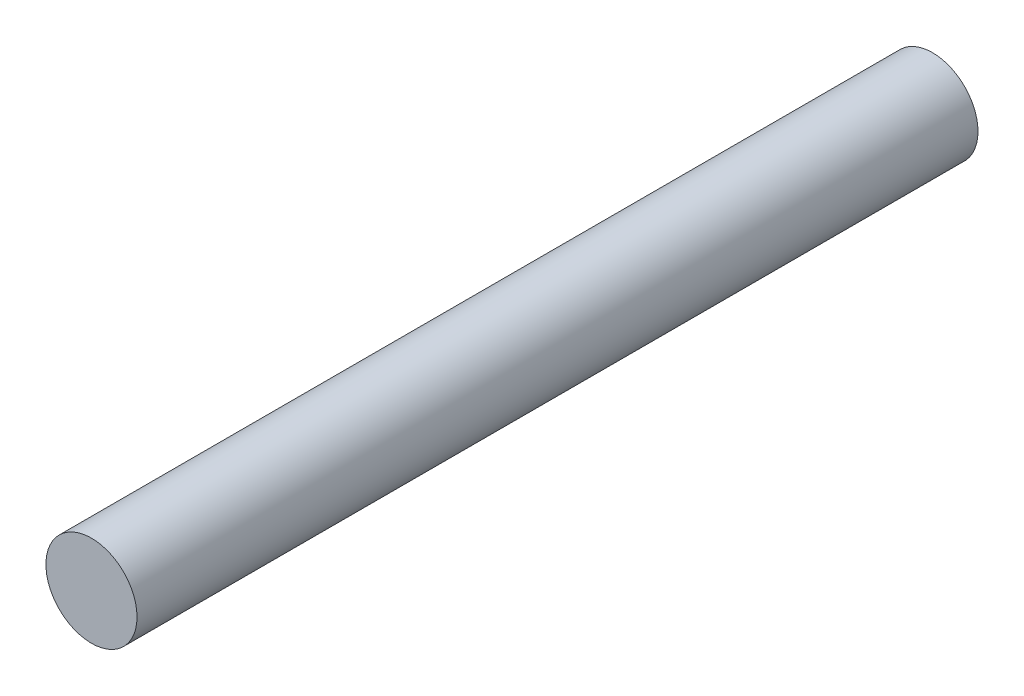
ISO-10303-21;
HEADER;
FILE_DESCRIPTION(('STEP AP214'),'2;1');
FILE_NAME('part.step','',(''),(''),'','','');
FILE_SCHEMA(('AUTOMOTIVE_DESIGN { 1 0 10303 214 1 1 1 1 }'));
ENDSEC;
DATA;
#1=APPLICATION_CONTEXT('core data for automotive mechanical design processes');
#2=APPLICATION_PROTOCOL_DEFINITION('international standard','automotive_design',2000,#1);
#3=PRODUCT_CONTEXT('',#1,'mechanical');
#4=PRODUCT('Part','Part','',(#3));
#5=PRODUCT_RELATED_PRODUCT_CATEGORY('part','',(#4));
#6=PRODUCT_DEFINITION_FORMATION('','',#4);
#7=PRODUCT_DEFINITION_CONTEXT('part definition',#1,'design');
#8=PRODUCT_DEFINITION('design','',#6,#7);
#9=PRODUCT_DEFINITION_SHAPE('','',#8);
#10=(LENGTH_UNIT() NAMED_UNIT(*) SI_UNIT(.MILLI.,.METRE.));
#11=(NAMED_UNIT(*) PLANE_ANGLE_UNIT() SI_UNIT($,.RADIAN.));
#12=(NAMED_UNIT(*) SI_UNIT($,.STERADIAN.) SOLID_ANGLE_UNIT());
#13=UNCERTAINTY_MEASURE_WITH_UNIT(LENGTH_MEASURE(1.E-05),#10,'distance_accuracy_value','');
#14=(GEOMETRIC_REPRESENTATION_CONTEXT(3) GLOBAL_UNCERTAINTY_ASSIGNED_CONTEXT((#13)) GLOBAL_UNIT_ASSIGNED_CONTEXT((#10,
#11,#12)) REPRESENTATION_CONTEXT('',''));
#15=CARTESIAN_POINT('',(0.,0.,0.));
#16=DIRECTION('',(0.,0.,1.));
#17=DIRECTION('',(1.,0.,0.));
#18=AXIS2_PLACEMENT_3D('',#15,#16,#17);
#19=CARTESIAN_POINT('',(0.,0.,60.));
#20=DIRECTION('',(0.,0.,-1.));
#21=DIRECTION('',(-1.,0.,0.));
#22=AXIS2_PLACEMENT_3D('',#19,#20,#21);
#23=CYLINDRICAL_SURFACE('',#22,3.25);
#24=CARTESIAN_POINT('',(0.,0.,60.));
#25=DIRECTION('',(0.,0.,1.));
#26=DIRECTION('',(1.,0.,0.));
#27=AXIS2_PLACEMENT_3D('',#24,#25,#26);
#28=CIRCLE('',#27,3.25);
#29=CARTESIAN_POINT('',(3.25,0.,60.));
#30=VERTEX_POINT('',#29);
#31=EDGE_CURVE('E8',#30,#30,#28,.T.);
#32=ORIENTED_EDGE('',*,*,#31,.F.);
#33=EDGE_LOOP('',(#32));
#34=FACE_BOUND('',#33,.T.);
#35=CARTESIAN_POINT('',(0.,0.,0.));
#36=DIRECTION('',(0.,0.,1.));
#37=DIRECTION('',(1.,0.,0.));
#38=AXIS2_PLACEMENT_3D('',#35,#36,#37);
#39=CIRCLE('',#38,3.25);
#40=CARTESIAN_POINT('',(3.25,0.,0.));
#41=VERTEX_POINT('',#40);
#42=EDGE_CURVE('E15',#41,#41,#39,.T.);
#43=ORIENTED_EDGE('',*,*,#42,.T.);
#44=EDGE_LOOP('',(#43));
#45=FACE_BOUND('',#44,.T.);
#46=ADVANCED_FACE('F12',(#34,#45),#23,.T.);
#47=CARTESIAN_POINT('',(0.,0.,60.));
#48=DIRECTION('',(0.,0.,1.));
#49=DIRECTION('',(1.,0.,0.));
#50=AXIS2_PLACEMENT_3D('',#47,#48,#49);
#51=PLANE('',#50);
#52=ORIENTED_EDGE('',*,*,#31,.T.);
#53=EDGE_LOOP('',(#52));
#54=FACE_BOUND('',#53,.T.);
#55=ADVANCED_FACE('F27',(#54),#51,.T.);
#56=CARTESIAN_POINT('',(0.,0.,0.));
#57=DIRECTION('',(0.,0.,1.));
#58=DIRECTION('',(1.,0.,0.));
#59=AXIS2_PLACEMENT_3D('',#56,#57,#58);
#60=PLANE('',#59);
#61=ORIENTED_EDGE('',*,*,#42,.F.);
#62=EDGE_LOOP('',(#61));
#63=FACE_BOUND('',#62,.T.);
#64=ADVANCED_FACE('F25',(#63),#60,.F.);
#65=CLOSED_SHELL('',(#46,#55,#64));
#66=MANIFOLD_SOLID_BREP('B1',#65);
#67=ADVANCED_BREP_SHAPE_REPRESENTATION('',(#18,#66),#14);
#68=SHAPE_DEFINITION_REPRESENTATION(#9,#67);
ENDSEC;
END-ISO-10303-21;
